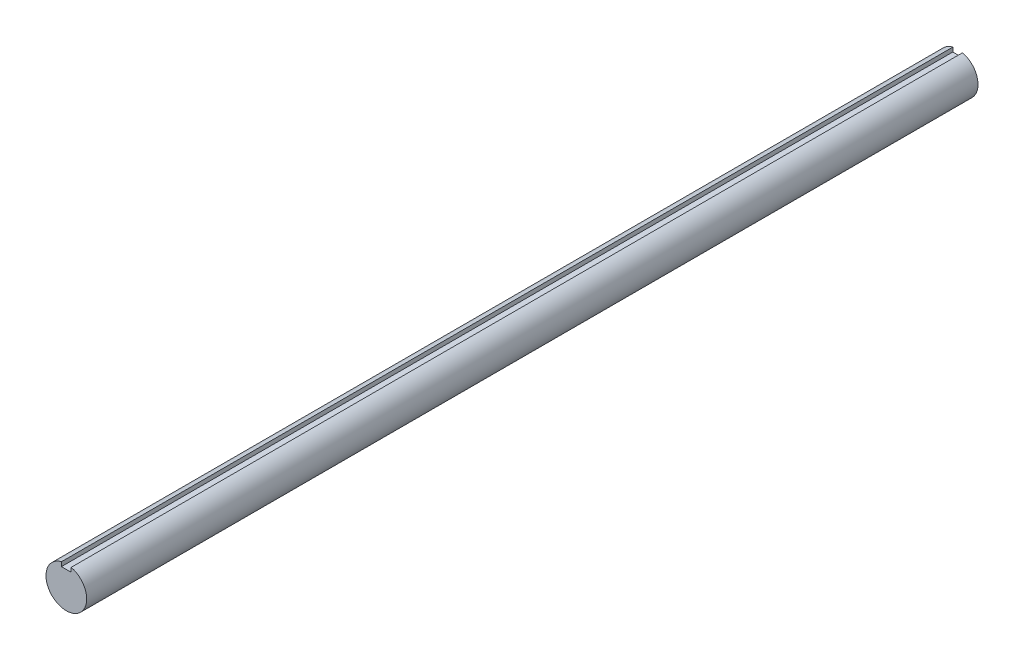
ISO-10303-21;
HEADER;
FILE_DESCRIPTION(('STEP AP214'),'2;1');
FILE_NAME('part.step','',(''),(''),'','','');
FILE_SCHEMA(('AUTOMOTIVE_DESIGN { 1 0 10303 214 1 1 1 1 }'));
ENDSEC;
DATA;
#1=APPLICATION_CONTEXT('core data for automotive mechanical design processes');
#2=APPLICATION_PROTOCOL_DEFINITION('international standard','automotive_design',2000,#1);
#3=PRODUCT_CONTEXT('',#1,'mechanical');
#4=PRODUCT('Part','Part','',(#3));
#5=PRODUCT_RELATED_PRODUCT_CATEGORY('part','',(#4));
#6=PRODUCT_DEFINITION_FORMATION('','',#4);
#7=PRODUCT_DEFINITION_CONTEXT('part definition',#1,'design');
#8=PRODUCT_DEFINITION('design','',#6,#7);
#9=PRODUCT_DEFINITION_SHAPE('','',#8);
#10=(LENGTH_UNIT() NAMED_UNIT(*) SI_UNIT(.MILLI.,.METRE.));
#11=(NAMED_UNIT(*) PLANE_ANGLE_UNIT() SI_UNIT($,.RADIAN.));
#12=(NAMED_UNIT(*) SI_UNIT($,.STERADIAN.) SOLID_ANGLE_UNIT());
#13=UNCERTAINTY_MEASURE_WITH_UNIT(LENGTH_MEASURE(1.E-05),#10,'distance_accuracy_value','');
#14=(GEOMETRIC_REPRESENTATION_CONTEXT(3) GLOBAL_UNCERTAINTY_ASSIGNED_CONTEXT((#13)) GLOBAL_UNIT_ASSIGNED_CONTEXT((#10,
#11,#12)) REPRESENTATION_CONTEXT('',''));
#15=CARTESIAN_POINT('',(0.,0.,0.));
#16=DIRECTION('',(0.,0.,1.));
#17=DIRECTION('',(1.,0.,0.));
#18=AXIS2_PLACEMENT_3D('',#15,#16,#17);
#19=CARTESIAN_POINT('',(0.,0.,173.96333));
#20=DIRECTION('',(0.,0.,-1.));
#21=DIRECTION('',(-1.,0.,0.));
#22=AXIS2_PLACEMENT_3D('',#19,#20,#21);
#23=CYLINDRICAL_SURFACE('',#22,7.93750000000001);
#24=CARTESIAN_POINT('',(0.,0.,-173.96333));
#25=DIRECTION('',(0.,0.,1.));
#26=DIRECTION('',(1.,0.,0.));
#27=AXIS2_PLACEMENT_3D('',#24,#25,#26);
#28=CIRCLE('',#27,7.93750000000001);
#29=CARTESIAN_POINT('',(-1.905,7.70550979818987,-173.96333));
#30=VERTEX_POINT('',#29);
#31=CARTESIAN_POINT('',(1.905,7.70550979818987,-173.96333));
#32=VERTEX_POINT('',#31);
#33=EDGE_CURVE('E91',#30,#32,#28,.T.);
#34=ORIENTED_EDGE('',*,*,#33,.T.);
#35=DIRECTION('',(0.,0.,-1.));
#36=VECTOR('',#35,1.);
#37=CARTESIAN_POINT('',(1.905,7.70550979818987,173.96333));
#38=LINE('',#37,#36);
#39=CARTESIAN_POINT('',(1.905,7.70550979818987,173.96333));
#40=VERTEX_POINT('',#39);
#41=EDGE_CURVE('E11',#40,#32,#38,.T.);
#42=ORIENTED_EDGE('',*,*,#41,.F.);
#43=CARTESIAN_POINT('',(0.,0.,173.96333));
#44=DIRECTION('',(0.,0.,1.));
#45=DIRECTION('',(1.,0.,0.));
#46=AXIS2_PLACEMENT_3D('',#43,#44,#45);
#47=CIRCLE('',#46,7.93750000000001);
#48=CARTESIAN_POINT('',(-1.905,7.70550979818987,173.96333));
#49=VERTEX_POINT('',#48);
#50=EDGE_CURVE('E79',#49,#40,#47,.T.);
#51=ORIENTED_EDGE('',*,*,#50,.F.);
#52=DIRECTION('',(0.,0.,-1.));
#53=VECTOR('',#52,1.);
#54=CARTESIAN_POINT('',(-1.905,7.70550979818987,173.96333));
#55=LINE('',#54,#53);
#56=EDGE_CURVE('E87',#49,#30,#55,.T.);
#57=ORIENTED_EDGE('',*,*,#56,.T.);
#58=EDGE_LOOP('',(#34,#42,#51,#57));
#59=FACE_BOUND('',#58,.T.);
#60=ADVANCED_FACE('F28',(#59),#23,.T.);
#61=CARTESIAN_POINT('',(1.905,7.70550979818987,173.96333));
#62=DIRECTION('',(1.,0.,0.));
#63=DIRECTION('',(0.,0.,-1.));
#64=AXIS2_PLACEMENT_3D('',#61,#62,#63);
#65=PLANE('',#64);
#66=DIRECTION('',(0.,-1.,0.));
#67=VECTOR('',#66,1.);
#68=CARTESIAN_POINT('',(1.905,7.70550979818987,-173.96333));
#69=LINE('',#68,#67);
#70=CARTESIAN_POINT('',(1.905,6.03250000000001,-173.96333));
#71=VERTEX_POINT('',#70);
#72=EDGE_CURVE('E83',#32,#71,#69,.T.);
#73=ORIENTED_EDGE('',*,*,#72,.T.);
#74=DIRECTION('',(0.,0.,-1.));
#75=VECTOR('',#74,1.);
#76=CARTESIAN_POINT('',(1.905,6.03250000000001,173.96333));
#77=LINE('',#76,#75);
#78=CARTESIAN_POINT('',(1.905,6.03250000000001,173.96333));
#79=VERTEX_POINT('',#78);
#80=EDGE_CURVE('E36',#79,#71,#77,.T.);
#81=ORIENTED_EDGE('',*,*,#80,.F.);
#82=DIRECTION('',(0.,-1.,0.));
#83=VECTOR('',#82,1.);
#84=CARTESIAN_POINT('',(1.905,7.70550979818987,173.96333));
#85=LINE('',#84,#83);
#86=EDGE_CURVE('E74',#40,#79,#85,.T.);
#87=ORIENTED_EDGE('',*,*,#86,.F.);
#88=ORIENTED_EDGE('',*,*,#41,.T.);
#89=EDGE_LOOP('',(#73,#81,#87,#88));
#90=FACE_BOUND('',#89,.T.);
#91=ADVANCED_FACE('F82',(#90),#65,.F.);
#92=CARTESIAN_POINT('',(1.905,6.03250000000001,173.96333));
#93=DIRECTION('',(0.,-1.,0.));
#94=DIRECTION('',(0.,0.,-1.));
#95=AXIS2_PLACEMENT_3D('',#92,#93,#94);
#96=PLANE('',#95);
#97=DIRECTION('',(-1.,0.,0.));
#98=VECTOR('',#97,1.);
#99=CARTESIAN_POINT('',(1.905,6.03250000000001,-173.96333));
#100=LINE('',#99,#98);
#101=CARTESIAN_POINT('',(-1.905,6.03250000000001,-173.96333));
#102=VERTEX_POINT('',#101);
#103=EDGE_CURVE('E61',#71,#102,#100,.T.);
#104=ORIENTED_EDGE('',*,*,#103,.T.);
#105=DIRECTION('',(0.,0.,-1.));
#106=VECTOR('',#105,1.);
#107=CARTESIAN_POINT('',(-1.905,6.03250000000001,173.96333));
#108=LINE('',#107,#106);
#109=CARTESIAN_POINT('',(-1.905,6.03250000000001,173.96333));
#110=VERTEX_POINT('',#109);
#111=EDGE_CURVE('E84',#110,#102,#108,.T.);
#112=ORIENTED_EDGE('',*,*,#111,.F.);
#113=DIRECTION('',(-1.,0.,0.));
#114=VECTOR('',#113,1.);
#115=CARTESIAN_POINT('',(1.905,6.03250000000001,173.96333));
#116=LINE('',#115,#114);
#117=EDGE_CURVE('E77',#79,#110,#116,.T.);
#118=ORIENTED_EDGE('',*,*,#117,.F.);
#119=ORIENTED_EDGE('',*,*,#80,.T.);
#120=EDGE_LOOP('',(#104,#112,#118,#119));
#121=FACE_BOUND('',#120,.T.);
#122=ADVANCED_FACE('F85',(#121),#96,.F.);
#123=CARTESIAN_POINT('',(-1.905,6.03250000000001,173.96333));
#124=DIRECTION('',(-1.,0.,0.));
#125=DIRECTION('',(0.,0.,1.));
#126=AXIS2_PLACEMENT_3D('',#123,#124,#125);
#127=PLANE('',#126);
#128=DIRECTION('',(0.,1.,0.));
#129=VECTOR('',#128,1.);
#130=CARTESIAN_POINT('',(-1.905,6.03250000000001,-173.96333));
#131=LINE('',#130,#129);
#132=EDGE_CURVE('E67',#102,#30,#131,.T.);
#133=ORIENTED_EDGE('',*,*,#132,.T.);
#134=ORIENTED_EDGE('',*,*,#56,.F.);
#135=DIRECTION('',(0.,1.,0.));
#136=VECTOR('',#135,1.);
#137=CARTESIAN_POINT('',(-1.905,6.03250000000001,173.96333));
#138=LINE('',#137,#136);
#139=EDGE_CURVE('E44',#110,#49,#138,.T.);
#140=ORIENTED_EDGE('',*,*,#139,.F.);
#141=ORIENTED_EDGE('',*,*,#111,.T.);
#142=EDGE_LOOP('',(#133,#134,#140,#141));
#143=FACE_BOUND('',#142,.T.);
#144=ADVANCED_FACE('F98',(#143),#127,.F.);
#145=CARTESIAN_POINT('',(0.,0.,173.96333));
#146=DIRECTION('',(0.,0.,1.));
#147=DIRECTION('',(1.,0.,0.));
#148=AXIS2_PLACEMENT_3D('',#145,#146,#147);
#149=PLANE('',#148);
#150=ORIENTED_EDGE('',*,*,#50,.T.);
#151=ORIENTED_EDGE('',*,*,#86,.T.);
#152=ORIENTED_EDGE('',*,*,#117,.T.);
#153=ORIENTED_EDGE('',*,*,#139,.T.);
#154=EDGE_LOOP('',(#150,#151,#152,#153));
#155=FACE_BOUND('',#154,.T.);
#156=ADVANCED_FACE('F75',(#155),#149,.T.);
#157=CARTESIAN_POINT('',(0.,0.,-173.96333));
#158=DIRECTION('',(0.,0.,1.));
#159=DIRECTION('',(1.,0.,0.));
#160=AXIS2_PLACEMENT_3D('',#157,#158,#159);
#161=PLANE('',#160);
#162=ORIENTED_EDGE('',*,*,#33,.F.);
#163=ORIENTED_EDGE('',*,*,#132,.F.);
#164=ORIENTED_EDGE('',*,*,#103,.F.);
#165=ORIENTED_EDGE('',*,*,#72,.F.);
#166=EDGE_LOOP('',(#162,#163,#164,#165));
#167=FACE_BOUND('',#166,.T.);
#168=ADVANCED_FACE('F101',(#167),#161,.F.);
#169=CLOSED_SHELL('',(#60,#91,#122,#144,#156,#168));
#170=MANIFOLD_SOLID_BREP('B2',#169);
#171=ADVANCED_BREP_SHAPE_REPRESENTATION('',(#18,#170),#14);
#172=SHAPE_DEFINITION_REPRESENTATION(#9,#171);
ENDSEC;
END-ISO-10303-21;
